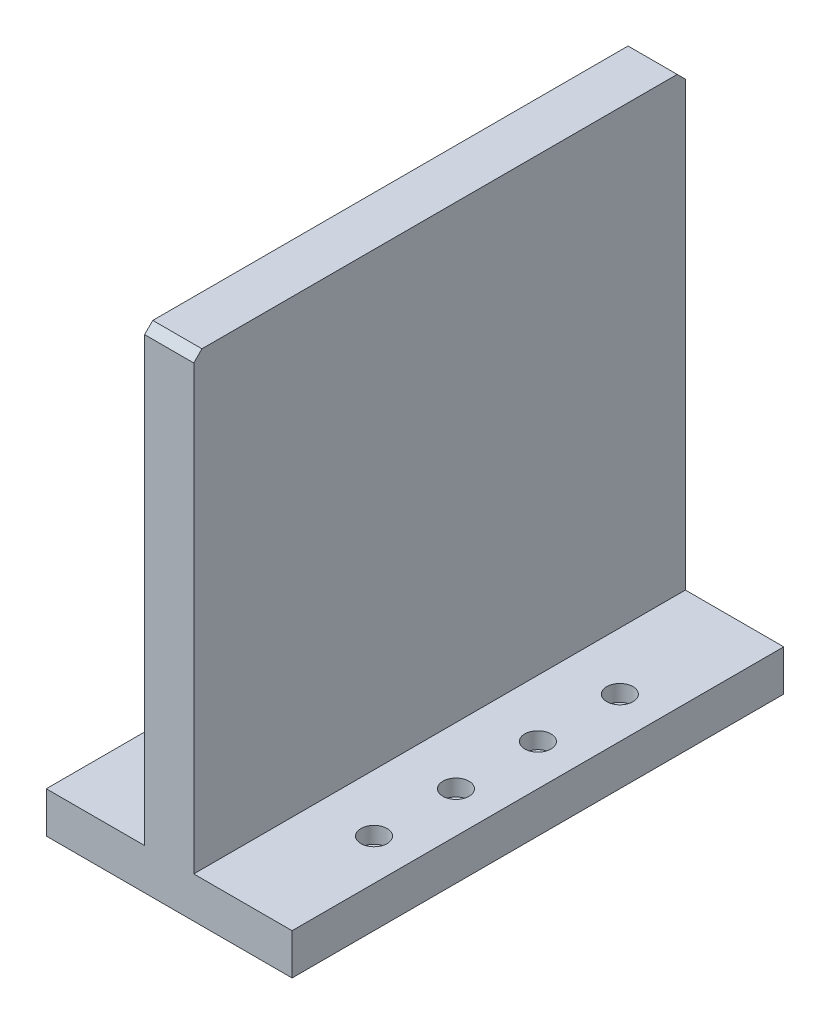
from build123d import *

# Parameters (mm, degrees)
BASE_EXTRUSION_DEPTH    = 300
CHANFREIN1_SIZE         = 5
ESQUISSE4_R             = 5
ENL_V_MAT_EXTRU_3_DEPTH = 30
ESQUISSE6_R             = 8
ENL_V_MAT_EXTRU_4_DEPTH = 10
ESQUISSE7_R             = 10
ENL_V_MAT_EXTRU_5_DEPTH = 20


with BuildPart() as part:
    # Esquisse1 → Base-Extrusion (new body)
    with BuildSketch(Plane.XY):
        Polygon((-15, 300), (15, 300), (15, 25), (75, 25), (75, 0), (-75, 0), (-75, 25), (-15, 25), align=None)
    extrude(amount=BASE_EXTRUSION_DEPTH)

    # Chanfrein1
    chanfrein1_edges = [part.edges().sort_by_distance(p)[0] for p in [
        (0, 300, 300),
        (0, 300, 0),
    ]]
    chamfer(chanfrein1_edges, length=CHANFREIN1_SIZE)

    # Esquisse4 → Enl_v. mat.-Extru.3 (cut)
    with BuildSketch(Plane(origin=(0, 0, 0), x_dir=(1, 0, 0), z_dir=(0, 1, 0))):
        with Locations(Location((-50, -75, 0), (0, 0, 90))):
            Circle(ESQUISSE4_R)
        with Locations(Location((-50, -125, 0), (0, 0, 90))):
            Circle(ESQUISSE4_R)
        with Locations(Location((-50, -175, 0), (0, 0, 90))):
            Circle(ESQUISSE4_R)
        with Locations(Location((-50, -225, 0), (0, 0, 90))):
            Circle(ESQUISSE4_R)
        with Locations((50, -225)):
            Circle(ESQUISSE4_R)
        with Locations((50, -175)):
            Circle(ESQUISSE4_R)
        with Locations((50, -125)):
            Circle(ESQUISSE4_R)
        with Locations((50, -75)):
            Circle(ESQUISSE4_R)
    extrude(amount=ENL_V_MAT_EXTRU_3_DEPTH, mode=Mode.SUBTRACT)

    # Esquisse6 → Enl_v. mat.-Extru.4 (cut)
    with BuildSketch(Plane(origin=(0, 25, 0), x_dir=(-1, 0, 0), z_dir=(0, 1, 0))):
        with Locations((-50, 225)):
            Circle(ESQUISSE6_R)
        with Locations((50, 225)):
            Circle(ESQUISSE6_R)
        with Locations((-50, 175)):
            Circle(ESQUISSE6_R)
        with Locations((50, 175)):
            Circle(ESQUISSE6_R)
        with Locations((-50, 125)):
            Circle(ESQUISSE6_R)
        with Locations((50, 125)):
            Circle(ESQUISSE6_R)
        with Locations((-50, 75)):
            Circle(ESQUISSE6_R)
        with Locations((50, 75)):
            Circle(ESQUISSE6_R)
    extrude(amount=-ENL_V_MAT_EXTRU_4_DEPTH, mode=Mode.SUBTRACT)

    # Esquisse7 → Enl_v. mat.-Extru.5 (cut)
    with BuildSketch(Plane(origin=(0, 0, 0), x_dir=(1, 0, 0), z_dir=(0, 1, 0))):
        with Locations(Location((0, -150, 0), (0, 0, 270))):
            Circle(ESQUISSE7_R)
    extrude(amount=ENL_V_MAT_EXTRU_5_DEPTH, mode=Mode.SUBTRACT)


solid = part.part
